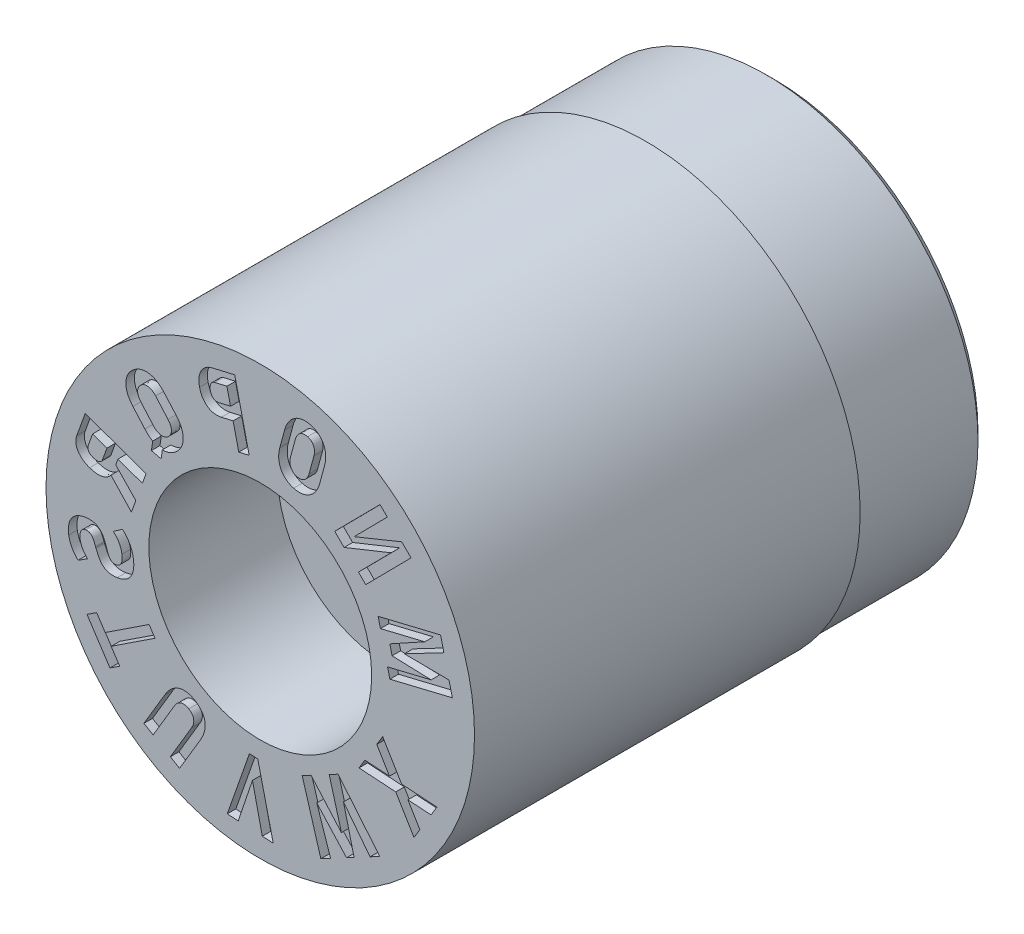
from build123d import *

# Parameters (mm, degrees)
SKETCH4_W          = 3
SKETCH4_H          = 1
CUT_EXTRUDE1_DEPTH = 0.2


with BuildPart() as part:
    # Sketch1 → Revolve1 (revolve)
    with BuildSketch(Plane(origin=(0, 0, 0), x_dir=(0, 0, -1), z_dir=(1, 0, 0)), mode=Mode.PRIVATE) as revolve1_sk:
        Polygon((0, 5), (0, 2.6), (3, 2.6), (3, 1.25), (12, 1.25), (12, 4.75), (11.75, 5), align=None)
    revolve(revolve1_sk.sketch.rotate(Axis((0, 0, 3.797909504), (0, 0, -1)), 90), axis=Axis((0, 0, 3.797909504), (0, 0, -1)))

    # Sketch4 → Cut-Revolve1 (revolve, cut)
    with BuildSketch(Plane(origin=(0, 0, 0), x_dir=(0, 0, -1), z_dir=(1, 0, 0)), mode=Mode.PRIVATE) as cut_revolve1_sk:
        with Locations((10.5, 5.435)):
            Rectangle(SKETCH4_W, SKETCH4_H)
    revolve(cut_revolve1_sk.sketch.rotate(Axis((0, 0, 0), (0, 0, -1)), 90), axis=Axis((0, 0, 0), (0, 0, -1)), mode=Mode.SUBTRACT)

    # Sketch5 → Cut-Extrude1 (cut)
    # profile 1 of 12: a face of its own
    with BuildSketch(Plane.XY):
        Polygon((4.286312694, 1.306940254), (4.208576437, 1.62736147), (2.750640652, 1.275007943), (2.804217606, 1.054164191), (3.839145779, 1.30427012), (3.024380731, 0.855363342), (3.076261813, 0.640519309), (3.986996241, 0.608730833), (2.971225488, 0.363254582), (3.024941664, 0.142138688), (4.482877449, 0.494492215), (4.405141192, 0.814913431), (3.363037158, 0.823624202), align=None)
    # profile 2 of 12: a face of its own
    with BuildSketch(Plane.XY):
        Polygon((3.519070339, 2.840419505), (3.301232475, 3.055736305), (2.190957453, 2.604921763), (2.965356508, 3.388090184), (2.795410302, 3.556232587), (1.737872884, 2.486813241), (1.956640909, 2.270283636), (3.054345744, 2.711036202), (2.291277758, 1.93944494), (2.461532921, 1.771000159), align=None)
    # profile 3 of 12: a face of its own
    with BuildSketch(Plane.XY):
        with BuildLine():
            Line((1.390128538, 3.28631436), (1.500789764, 3.695544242))
            add(Edge.make_bspline(
                [(1.500789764, 3.695544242), (1.514147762, 3.745621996), (1.528048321, 3.82092721), (1.528326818, 3.920557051), (1.521402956, 3.979278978), (1.511760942, 4.024213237), (1.50225362, 4.056347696), (1.491306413, 4.087306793), (1.47821599, 4.117018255), (1.462501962, 4.145005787), (1.445667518, 4.172129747), (1.426512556, 4.197783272), (1.405346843, 4.222010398), (1.382605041, 4.244974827), (1.357954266, 4.265880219), (1.332085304, 4.285344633), (1.304507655, 4.302775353), (1.27528629, 4.318378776), (1.233534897, 4.336795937), (1.200752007, 4.34801739), (1.178193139, 4.353955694)],
                knots=[0, 0, 0, 0, 0.188633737, 0.276446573, 0.361356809, 0.403048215, 0.4434031, 0.483104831, 0.522380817, 0.561263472, 0.599705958, 0.638378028, 0.677506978, 0.716595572, 0.755761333, 0.794913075, 0.834210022, 0.874247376, 0.915239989, 1, 1, 1, 1], degree=3))
            add(Edge.make_bspline(
                [(1.178193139, 4.353955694), (1.155738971, 4.360467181), (1.121688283, 4.366948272), (1.076353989, 4.372158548), (1.043146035, 4.373177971), (1.010421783, 4.372280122), (0.978251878, 4.368625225), (0.946540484, 4.362814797), (0.91549535, 4.354494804), (0.884958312, 4.344392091), (0.855644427, 4.331575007), (0.827254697, 4.316918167), (0.799703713, 4.300352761), (0.773504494, 4.281170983), (0.748074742, 4.260258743), (0.72394735, 4.23689203), (0.700720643, 4.211697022), (0.67900077, 4.184370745), (0.658204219, 4.155770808), (0.639470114, 4.125186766), (0.622262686, 4.092953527), (0.605919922, 4.059204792), (0.586734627, 4.010891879), (0.574177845, 3.973430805), (0.56758295, 3.947621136)],
                knots=[0, 0, 0, 0, 0.08483475, 0.125779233, 0.165706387, 0.205468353, 0.244646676, 0.283244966, 0.322521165, 0.361362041, 0.40002245, 0.438647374, 0.477421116, 0.516711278, 0.556542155, 0.596979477, 0.638670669, 0.680985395, 0.72376421, 0.767103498, 0.811194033, 0.856522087, 0.903286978, 1, 1, 1, 1], degree=3))
            Line((0.56758295, 3.947621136), (0.456921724, 3.538391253))
            add(Edge.make_bspline(
                [(0.456921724, 3.538391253), (0.443357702, 3.488309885), (0.429888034, 3.4129637), (0.429864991, 3.313410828), (0.43664145, 3.254888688), (0.44642717, 3.210079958), (0.455358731, 3.177825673), (0.46714328, 3.147164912), (0.479844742, 3.117328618), (0.495281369, 3.089205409), (0.512212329, 3.062078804), (0.531348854, 3.036413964), (0.552519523, 3.012189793), (0.575260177, 2.989225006), (0.599910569, 2.96831808), (0.625782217, 2.948860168), (0.653435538, 2.931350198), (0.68278369, 2.915809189), (0.724333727, 2.896722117), (0.75728456, 2.88589968), (0.779782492, 2.879825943)],
                knots=[0, 0, 0, 0, 0.188813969, 0.276321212, 0.361245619, 0.402420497, 0.443038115, 0.482794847, 0.52177743, 0.560858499, 0.599307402, 0.637985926, 0.677121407, 0.716216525, 0.755388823, 0.794547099, 0.833850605, 0.874264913, 0.915225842, 1, 1, 1, 1], degree=3))
            add(Edge.make_bspline(
                [(0.779782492, 2.879825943), (0.80238653, 2.87416152), (0.836178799, 2.866318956), (0.881581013, 2.86220415), (0.914714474, 2.86097771), (0.947444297, 2.861932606), (0.979615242, 2.865565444), (1.01131712, 2.871407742), (1.042474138, 2.879640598), (1.072865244, 2.890141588), (1.10231798, 2.902594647), (1.130715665, 2.917290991), (1.158106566, 2.934091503), (1.184486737, 2.953017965), (1.20973184, 2.974047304), (1.234161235, 2.996989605), (1.257285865, 3.022187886), (1.279081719, 3.049324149), (1.299337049, 3.078294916), (1.318647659, 3.108615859), (1.335855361, 3.140888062), (1.35172316, 3.174863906), (1.371048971, 3.223010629), (1.383495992, 3.260521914), (1.390128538, 3.28631436)],
                knots=[0, 0, 0, 0, 0.084853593, 0.125633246, 0.165579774, 0.205361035, 0.24455837, 0.283175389, 0.322470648, 0.361610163, 0.399991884, 0.438635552, 0.47775402, 0.516724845, 0.55657505, 0.597135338, 0.638484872, 0.68082013, 0.723586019, 0.766957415, 0.811439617, 0.856452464, 0.903240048, 1, 1, 1, 1], degree=3))
        make_face()
        with BuildLine():
            Line((0.704510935, 3.464219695), (0.818926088, 3.887182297))
            add(Edge.make_bspline(
                [(0.818926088, 3.887182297), (0.825292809, 3.910969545), (0.837655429, 3.945198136), (0.861035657, 3.986344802), (0.880815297, 4.013239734), (0.903185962, 4.036271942), (0.927274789, 4.056004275), (0.953670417, 4.071265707), (0.981757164, 4.082213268), (1.011194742, 4.089117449), (1.052654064, 4.09241989), (1.084144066, 4.087630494), (1.104653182, 4.081942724)],
                knots=[0, 0, 0, 0, 0.189969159, 0.278746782, 0.364115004, 0.446619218, 0.525697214, 0.603456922, 0.680631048, 0.757323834, 0.835778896, 1, 1, 1, 1], degree=3))
            add(Edge.make_bspline(
                [(1.104653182, 4.081942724), (1.125189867, 4.076556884), (1.154724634, 4.064934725), (1.188915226, 4.041226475), (1.210719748, 4.020239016), (1.229367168, 3.996595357), (1.244556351, 3.970350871), (1.255321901, 3.941213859), (1.262905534, 3.910038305), (1.266694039, 3.876854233), (1.266113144, 3.829549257), (1.259741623, 3.79376419), (1.253354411, 3.769979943)],
                knots=[0, 0, 0, 0, 0.164009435, 0.242129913, 0.3197738, 0.396745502, 0.473913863, 0.552775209, 0.635660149, 0.721077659, 0.80985478, 1, 1, 1, 1], degree=3))
            Line((1.253354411, 3.769979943), (1.138939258, 3.347017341))
            add(Edge.make_bspline(
                [(1.138939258, 3.347017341), (1.132568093, 3.323233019), (1.120218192, 3.288996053), (1.09676814, 3.247774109), (1.076965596, 3.220772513), (1.054616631, 3.197704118), (1.030495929, 3.178149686), (1.004219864, 3.163049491), (0.976287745, 3.151667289), (0.9467808, 3.145089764), (0.905366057, 3.142335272), (0.87394477, 3.146182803), (0.853476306, 3.152103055)],
                knots=[0, 0, 0, 0, 0.190102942, 0.278943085, 0.365152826, 0.447715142, 0.526115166, 0.603929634, 0.680672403, 0.757992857, 0.836057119, 1, 1, 1, 1], degree=3))
            add(Edge.make_bspline(
                [(0.853476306, 3.152103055), (0.833013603, 3.157900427), (0.803383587, 3.169356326), (0.769392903, 3.193223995), (0.747304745, 3.213736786), (0.728784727, 3.237572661), (0.713267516, 3.263728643), (0.702667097, 3.292944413), (0.694632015, 3.324020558), (0.691266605, 3.357277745), (0.691682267, 3.404639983), (0.69816131, 3.440441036), (0.704510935, 3.464219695)],
                knots=[0, 0, 0, 0, 0.164568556, 0.241873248, 0.31930577, 0.396245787, 0.474064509, 0.552893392, 0.635179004, 0.721192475, 0.809933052, 1, 1, 1, 1], degree=3))
        make_face(mode=Mode.SUBTRACT)
    # profile 4 of 12: a face of its own
    with BuildSketch(Plane.XY):
        with BuildLine():
            Line((-0.632674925, 3.533388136), (-0.501645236, 2.967718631))
            Line((-0.501645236, 2.967718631), (-0.258324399, 3.023986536))
            Line((-0.258324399, 3.023986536), (-0.59608493, 4.482135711))
            Line((-0.59608493, 4.482135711), (-1.113828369, 4.362230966))
            add(Edge.make_bspline(
                [(-1.113828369, 4.362230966), (-1.152065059, 4.353252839), (-1.207346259, 4.334209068), (-1.27244915, 4.294149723), (-1.314553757, 4.258439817), (-1.350838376, 4.217466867), (-1.381189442, 4.171843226), (-1.404553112, 4.121482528), (-1.42115562, 4.067060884), (-1.431668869, 4.009246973), (-1.434423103, 3.926247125), (-1.426326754, 3.863151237), (-1.416307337, 3.82117902)],
                knots=[0, 0, 0, 0, 0.169181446, 0.248915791, 0.327591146, 0.405821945, 0.483634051, 0.562500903, 0.643749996, 0.727834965, 0.814528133, 1, 1, 1, 1], degree=3))
            add(Edge.make_bspline(
                [(-1.416307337, 3.82117902), (-1.40699449, 3.778963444), (-1.386500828, 3.718632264), (-1.347056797, 3.645664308), (-1.312635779, 3.598192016), (-1.273592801, 3.55711733), (-1.230507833, 3.522424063), (-1.183518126, 3.494725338), (-1.132736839, 3.474403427), (-1.079294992, 3.461315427), (-1.003342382, 3.453748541), (-0.94544113, 3.4613555), (-0.907150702, 3.469777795)],
                knots=[0, 0, 0, 0, 0.186189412, 0.272787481, 0.356605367, 0.438128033, 0.51630851, 0.594255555, 0.672297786, 0.751180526, 0.830638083, 1, 1, 1, 1], degree=3))
            Line((-0.907150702, 3.469777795), (-0.632674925, 3.533388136))
        make_face()
        with BuildLine():
            Line((-0.693988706, 3.798086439), (-0.9748553, 3.733027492))
            add(Edge.make_bspline(
                [(-0.9748553, 3.733027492), (-0.988719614, 3.729988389), (-1.009876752, 3.727725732), (-1.037464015, 3.731631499), (-1.057166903, 3.737365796), (-1.075659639, 3.746512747), (-1.09347746, 3.757638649), (-1.109268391, 3.772413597), (-1.12403514, 3.789345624), (-1.13732978, 3.808659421), (-1.151962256, 3.838517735), (-1.160171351, 3.862598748), (-1.16380735, 3.879549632)],
                knots=[0, 0, 0, 0, 0.15921735, 0.234811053, 0.310679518, 0.387797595, 0.465050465, 0.544886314, 0.628703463, 0.71627665, 0.806375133, 1, 1, 1, 1], degree=3))
            add(Edge.make_bspline(
                [(-1.16380735, 3.879549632), (-1.168086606, 3.896534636), (-1.171497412, 3.922112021), (-1.171417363, 3.955664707), (-1.168430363, 3.979133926), (-1.162947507, 4.001110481), (-1.155206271, 4.021459), (-1.14472496, 4.039742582), (-1.131869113, 4.055915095), (-1.116659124, 4.069896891), (-1.09318279, 4.085459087), (-1.073086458, 4.093131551), (-1.059001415, 4.096092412)],
                knots=[0, 0, 0, 0, 0.194026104, 0.285030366, 0.37157159, 0.455815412, 0.535818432, 0.612326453, 0.688683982, 0.764157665, 0.840582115, 1, 1, 1, 1], degree=3))
            Line((-1.059001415, 4.096092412), (-0.778090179, 4.1611617))
            Line((-0.778090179, 4.1611617), (-0.693988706, 3.798086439))
        make_face(mode=Mode.SUBTRACT)
    # profile 5 of 12: a face of its own
    with BuildSketch(Plane.XY):
        with BuildLine():
            Line((-3.32129826, 1.417403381), (-2.750924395, 1.211899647))
            Line((-2.750924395, 1.211899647), (-2.665936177, 1.447691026))
            Line((-2.665936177, 1.447691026), (-4.084482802, 1.958788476))
            Line((-4.084482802, 1.958788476), (-4.281891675, 1.410645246))
            add(Edge.make_bspline(
                [(-4.281891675, 1.410645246), (-4.294035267, 1.378038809), (-4.304719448, 1.327343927), (-4.304502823, 1.25928486), (-4.295699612, 1.210117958), (-4.280187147, 1.162459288), (-4.256829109, 1.11713815), (-4.226806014, 1.074286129), (-4.189869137, 1.034148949), (-4.146362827, 0.997582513), (-4.079168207, 0.9520153), (-4.022021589, 0.926674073), (-3.982234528, 0.912175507)],
                knots=[0, 0, 0, 0, 0.159553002, 0.235612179, 0.311314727, 0.388075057, 0.465029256, 0.544635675, 0.627784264, 0.714856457, 0.805171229, 1, 1, 1, 1], degree=3))
            add(Edge.make_bspline(
                [(-3.982234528, 0.912175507), (-3.942533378, 0.897266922), (-3.882237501, 0.881764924), (-3.801664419, 0.872828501), (-3.744874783, 0.873810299), (-3.690931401, 0.881013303), (-3.640335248, 0.894596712), (-3.593832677, 0.915539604), (-3.551162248, 0.942232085), (-3.513925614, 0.974248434), (-3.492953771, 0.998790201), (-3.483651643, 1.011259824)],
                knots=[0, 0, 0, 0, 0.194722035, 0.284885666, 0.371920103, 0.455138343, 0.534536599, 0.611838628, 0.688719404, 0.765189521, 0.836632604, 0.836632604, 0.836632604, 0.836632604], degree=3))
            Line((-3.483651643, 1.011259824), (-3.006901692, 0.501392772))
            Line((-3.006901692, 0.501392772), (-2.903949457, 0.787036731))
            Line((-2.903949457, 0.787036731), (-3.372721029, 1.274569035))
            Line((-3.372721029, 1.274569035), (-3.32129826, 1.417403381))
        make_face()
        with BuildLine():
            Line((-3.578524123, 1.51008097), (-3.684165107, 1.21695499))
            add(Edge.make_bspline(
                [(-3.684165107, 1.21695499), (-3.688186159, 1.205435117), (-3.696678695, 1.189096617), (-3.71308205, 1.171282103), (-3.727502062, 1.160355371), (-3.743699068, 1.151568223), (-3.761442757, 1.144493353), (-3.781009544, 1.140473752), (-3.801978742, 1.138839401), (-3.824052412, 1.139478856), (-3.855545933, 1.143137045), (-3.879102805, 1.149420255), (-3.894830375, 1.154702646)],
                knots=[0, 0, 0, 0, 0.149319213, 0.221694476, 0.294550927, 0.369529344, 0.446510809, 0.527282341, 0.612761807, 0.703262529, 0.796933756, 1, 1, 1, 1], degree=3))
            add(Edge.make_bspline(
                [(-3.894830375, 1.154702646), (-3.910758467, 1.159922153), (-3.932800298, 1.170554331), (-3.959967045, 1.187105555), (-3.977039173, 1.201082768), (-3.991896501, 1.215727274), (-4.00454748, 1.23110805), (-4.013796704, 1.247828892), (-4.020762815, 1.26494886), (-4.024634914, 1.282658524), (-4.025554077, 1.307051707), (-4.022190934, 1.325339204), (-4.017624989, 1.336974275)],
                knots=[0, 0, 0, 0, 0.203595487, 0.297555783, 0.386975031, 0.471746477, 0.551629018, 0.628661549, 0.703686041, 0.7762233, 0.848312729, 1, 1, 1, 1], degree=3))
            Line((-4.017624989, 1.336974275), (-3.911944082, 1.63021103))
            Line((-3.911944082, 1.63021103), (-3.578524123, 1.51008097))
        make_face(mode=Mode.SUBTRACT)
    # profile 6 of 12: a face of its own
    with BuildSketch(Plane.XY):
        Polygon((-3.617986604, -2.236734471), (-3.817365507, -1.933942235), (-4.04421609, -2.083374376), (-3.507591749, -2.89833364), (-3.280741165, -2.748901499), (-3.480111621, -2.446122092), (-2.456432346, -1.772165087), (-2.594437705, -1.562863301), align=None)
    # profile 7 of 12: a face of its own
    with BuildSketch(Plane.XY):
        with BuildLine():
            Line((-2.51003597, 2.18750577), (-2.54015432, 1.979473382))
            Line((-2.54015432, 1.979473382), (-2.313098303, 1.923851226))
            Line((-2.313098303, 1.923851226), (-2.284762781, 2.122112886))
            add(Edge.make_bspline(
                [(-2.284762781, 2.122112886), (-2.277533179, 2.121919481), (-2.259621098, 2.121880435), (-2.230974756, 2.123313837), (-2.199049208, 2.127614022), (-2.167344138, 2.133850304), (-2.136252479, 2.142878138), (-2.105712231, 2.154168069), (-2.075556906, 2.167330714), (-2.046328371, 2.183611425), (-2.007343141, 2.207849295), (-1.980136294, 2.229713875), (-1.962331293, 2.244898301)],
                knots=[0.572911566, 0.572911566, 0.572911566, 0.572911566, 0.599119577, 0.637799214, 0.676765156, 0.715771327, 0.754807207, 0.793954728, 0.833729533, 0.873913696, 0.915098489, 1, 1, 1, 1], degree=3))
            add(Edge.make_bspline(
                [(-1.962331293, 2.244898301), (-1.945017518, 2.260587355), (-1.919824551, 2.284590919), (-1.890719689, 2.319981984), (-1.871429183, 2.347196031), (-1.854293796, 2.3751763), (-1.838933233, 2.403872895), (-1.826182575, 2.433688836), (-1.812356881, 2.474434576), (-1.800533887, 2.526960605), (-1.796027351, 2.591571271), (-1.800671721, 2.657423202), (-1.812315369, 2.712427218), (-1.826033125, 2.756411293), (-1.838955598, 2.789368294), (-1.853656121, 2.822076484), (-1.871035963, 2.854304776), (-1.890201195, 2.886500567), (-1.919705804, 2.929263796), (-1.944402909, 2.960071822), (-1.962014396, 2.980012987)],
                knots=[0, 0, 0, 0, 0.08482015, 0.125833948, 0.166006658, 0.205705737, 0.244763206, 0.283951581, 0.32316086, 0.40071608, 0.478448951, 0.557229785, 0.639391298, 0.681720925, 0.724221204, 0.767703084, 0.811693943, 0.856942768, 0.903529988, 1, 1, 1, 1], degree=3))
            Line((-1.962014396, 2.980012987), (-2.242218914, 3.298670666))
            add(Edge.make_bspline(
                [(-2.242218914, 3.298670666), (-2.276671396, 3.337391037), (-2.331797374, 3.390668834), (-2.414830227, 3.445915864), (-2.467587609, 3.472856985), (-2.510693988, 3.489048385), (-2.542690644, 3.499230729), (-2.574810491, 3.506671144), (-2.606837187, 3.512182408), (-2.638926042, 3.515109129), (-2.670995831, 3.515461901), (-2.703067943, 3.51382725), (-2.735061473, 3.509679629), (-2.766628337, 3.502841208), (-2.797855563, 3.49437914), (-2.828430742, 3.48305989), (-2.858338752, 3.469411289), (-2.887806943, 3.453744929), (-2.92627101, 3.428921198), (-2.953981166, 3.407927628), (-2.971415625, 3.392234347)],
                knots=[0, 0, 0, 0, 0.188187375, 0.275929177, 0.360881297, 0.402284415, 0.442800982, 0.482543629, 0.521736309, 0.560559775, 0.599240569, 0.637939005, 0.676923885, 0.716069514, 0.754979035, 0.794145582, 0.834133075, 0.874120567, 0.915041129, 1, 1, 1, 1], degree=3))
            add(Edge.make_bspline(
                [(-2.971415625, 3.392234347), (-2.989024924, 3.376699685), (-3.013690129, 3.352044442), (-3.043430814, 3.317006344), (-3.062536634, 3.289702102), (-3.079936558, 3.261882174), (-3.094995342, 3.233131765), (-3.107951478, 3.203412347), (-3.121619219, 3.162705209), (-3.133947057, 3.110290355), (-3.138283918, 3.045632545), (-3.133727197, 2.979883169), (-3.121990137, 2.924982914), (-3.108189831, 2.881044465), (-3.095582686, 2.847954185), (-3.080459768, 2.815344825), (-3.063432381, 2.782941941), (-3.044144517, 2.750711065), (-3.014544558, 2.707937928), (-2.990203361, 2.676763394), (-2.972378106, 2.656895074)],
                knots=[0, 0, 0, 0, 0.08508328, 0.126277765, 0.166433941, 0.205779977, 0.245167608, 0.283984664, 0.323177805, 0.40073542, 0.478436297, 0.557184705, 0.63896357, 0.681275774, 0.724083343, 0.76723381, 0.811508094, 0.856738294, 0.90330634, 1, 1, 1, 1], degree=3))
            Line((-2.972378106, 2.656895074), (-2.692173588, 2.338237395))
            add(Edge.make_bspline(
                [(-2.692173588, 2.338237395), (-2.657671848, 2.299568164), (-2.602718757, 2.246176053), (-2.536512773, 2.202407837), (-2.512753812, 2.189009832), (-2.51003597, 2.18750577)],
                knots=[0, 0, 0, 0, 0.188095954, 0.275632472, 0.286882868, 0.286882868, 0.286882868, 0.286882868], degree=3))
        make_face()
        with BuildLine():
            Line((-2.49213704, 2.504659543), (-2.781773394, 2.83378663))
            add(Edge.make_bspline(
                [(-2.781773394, 2.83378663), (-2.798160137, 2.852351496), (-2.819589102, 2.881784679), (-2.841101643, 2.924054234), (-2.852415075, 2.955355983), (-2.859713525, 2.986677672), (-2.862243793, 3.017653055), (-2.860127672, 3.048120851), (-2.853850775, 3.077720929), (-2.843347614, 3.106320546), (-2.822951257, 3.142901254), (-2.801282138, 3.166507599), (-2.785215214, 3.180695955)],
                knots=[0, 0, 0, 0, 0.190295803, 0.278272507, 0.363741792, 0.445510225, 0.524772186, 0.601669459, 0.679458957, 0.756595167, 0.834985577, 1, 1, 1, 1], degree=3))
            add(Edge.make_bspline(
                [(-2.785215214, 3.180695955), (-2.769176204, 3.194776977), (-2.742896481, 3.21276088), (-2.704191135, 3.228538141), (-2.674583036, 3.235521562), (-2.644430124, 3.237768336), (-2.614089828, 3.235670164), (-2.583657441, 3.229288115), (-2.553539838, 3.218085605), (-2.523944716, 3.202779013), (-2.48485403, 3.175997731), (-2.458414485, 3.150936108), (-2.442255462, 3.132248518)],
                knots=[0, 0, 0, 0, 0.164323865, 0.242647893, 0.320593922, 0.397514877, 0.474531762, 0.554006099, 0.636025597, 0.721137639, 0.809891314, 1, 1, 1, 1], degree=3))
            Line((-2.442255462, 3.132248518), (-2.152619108, 2.80312143))
            add(Edge.make_bspline(
                [(-2.152619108, 2.80312143), (-2.136484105, 2.784485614), (-2.114643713, 2.755409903), (-2.093272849, 2.713145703), (-2.08187543, 2.681775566), (-2.074696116, 2.650315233), (-2.072249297, 2.619255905), (-2.073858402, 2.58885577), (-2.080173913, 2.559298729), (-2.091083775, 2.530945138), (-2.111297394, 2.494428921), (-2.132774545, 2.470815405), (-2.148795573, 2.456779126)],
                knots=[0, 0, 0, 0, 0.189977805, 0.278085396, 0.363681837, 0.446308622, 0.525688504, 0.602752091, 0.679875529, 0.75730548, 0.835812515, 1, 1, 1, 1], degree=3))
            add(Edge.make_bspline(
                [(-2.148795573, 2.456779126), (-2.164689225, 2.442218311), (-2.191360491, 2.424587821), (-2.230069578, 2.408700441), (-2.259586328, 2.401702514), (-2.289625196, 2.399028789), (-2.320032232, 2.40112285), (-2.350360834, 2.407982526), (-2.380602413, 2.41910574), (-2.410251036, 2.434410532), (-2.449713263, 2.46073351), (-2.475901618, 2.48608442), (-2.49213704, 2.504659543)],
                knots=[0, 0, 0, 0, 0.165328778, 0.243569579, 0.320699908, 0.397702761, 0.474637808, 0.554093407, 0.636025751, 0.721784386, 0.810093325, 1, 1, 1, 1], degree=3))
        make_face(mode=Mode.SUBTRACT)
    # profile 8 of 12: a face of its own
    with BuildSketch(Plane.XY):
        with BuildLine():
            Line((-3.215677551, 0.049791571), (-3.429618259, -0.099031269))
            add(Edge.make_bspline(
                [(-3.429618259, -0.099031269), (-3.402436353, -0.120759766), (-3.365416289, -0.157886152), (-3.322848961, -0.21351659), (-3.294958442, -0.258813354), (-3.271187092, -0.306531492), (-3.244631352, -0.372220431), (-3.232692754, -0.424013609), (-3.227574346, -0.458858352)],
                knots=[0, 0, 0, 0, 0.24699557, 0.371005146, 0.497151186, 0.624435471, 0.749537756, 1, 1, 1, 1], degree=3))
            add(Edge.make_bspline(
                [(-3.227574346, -0.458858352), (-3.224926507, -0.477960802), (-3.22159562, -0.50610811), (-3.221923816, -0.542816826), (-3.223173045, -0.568111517), (-3.226449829, -0.591871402), (-3.231373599, -0.614121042), (-3.237868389, -0.634955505), (-3.246462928, -0.654039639), (-3.256028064, -0.671801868), (-3.267883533, -0.687285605), (-3.280809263, -0.701172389), (-3.295281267, -0.71326396), (-3.311517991, -0.723081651), (-3.335663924, -0.733604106), (-3.35516144, -0.738398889), (-3.368585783, -0.74042539)],
                knots=[0, 0, 0, 0, 0.163211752, 0.238687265, 0.310056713, 0.377124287, 0.441113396, 0.502499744, 0.561161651, 0.617797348, 0.672569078, 0.725446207, 0.777915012, 0.831391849, 0.885228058, 1, 1, 1, 1], degree=3))
            add(Edge.make_bspline(
                [(-3.368585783, -0.74042539), (-3.387389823, -0.743776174), (-3.413898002, -0.74369594), (-3.447102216, -0.735626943), (-3.468031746, -0.724648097), (-3.486571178, -0.710677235), (-3.503300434, -0.694193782), (-3.51795234, -0.674877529), (-3.530726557, -0.652810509), (-3.542396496, -0.627743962), (-3.558789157, -0.588292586), (-3.570534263, -0.556755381), (-3.577849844, -0.534429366)],
                knots=[0, 0, 0, 0, 0.167076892, 0.241680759, 0.312795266, 0.383261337, 0.45517203, 0.528631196, 0.606108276, 0.689828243, 0.783415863, 1, 1, 1, 1], degree=3))
            add(Edge.make_bspline(
                [(-3.577849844, -0.534429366), (-3.57831097, -0.532755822), (-3.579406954, -0.52945729), (-3.580178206, -0.52602295), (-3.581376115, -0.524633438)],
                knots=[0, 0, 0, 0, 0.496792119, 1, 1, 1, 1], degree=3))
            Line((-3.581376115, -0.524633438), (-3.587082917, -0.50528212))
            add(Edge.make_bspline(
                [(-3.587082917, -0.50528212), (-3.600373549, -0.465686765), (-3.620693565, -0.409001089), (-3.652801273, -0.339212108), (-3.676515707, -0.294256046), (-3.703884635, -0.254106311), (-3.737675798, -0.21927375), (-3.777364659, -0.188580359), (-3.814984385, -0.166994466), (-3.848315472, -0.152681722), (-3.875782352, -0.14380669), (-3.905398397, -0.137820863), (-3.936941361, -0.133470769), (-3.970445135, -0.131844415), (-4.019352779, -0.132096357), (-4.05687994, -0.135935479), (-4.082481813, -0.139543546)],
                knots=[0, 0, 0, 0, 0.181067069, 0.260489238, 0.332707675, 0.401119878, 0.470233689, 0.542036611, 0.617915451, 0.657429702, 0.699064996, 0.742722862, 0.788178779, 0.836914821, 0.887917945, 1, 1, 1, 1], degree=3))
            Line((-4.082481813, -0.139543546), (-4.08365462, -0.139889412))
            add(Edge.make_bspline(
                [(-4.08365462, -0.139889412), (-4.106905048, -0.143009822), (-4.140786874, -0.149969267), (-4.184410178, -0.162158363), (-4.214894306, -0.17317891), (-4.243936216, -0.185503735), (-4.271545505, -0.199284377), (-4.297392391, -0.214943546), (-4.321565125, -0.232255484), (-4.344043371, -0.251091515), (-4.36519655, -0.270956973), (-4.384314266, -0.292518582), (-4.401373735, -0.315695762), (-4.417525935, -0.339679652), (-4.431030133, -0.365576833), (-4.443442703, -0.392559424), (-4.457225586, -0.430982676), (-4.47033339, -0.482493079), (-4.479782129, -0.573485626), (-4.476401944, -0.644169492), (-4.468983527, -0.692057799)],
                knots=[0, 0, 0, 0, 0.091894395, 0.135435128, 0.177444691, 0.218865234, 0.259058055, 0.298296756, 0.337204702, 0.375492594, 0.413186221, 0.450869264, 0.488256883, 0.52595051, 0.564081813, 0.602598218, 0.642303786, 0.723961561, 0.810241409, 1, 1, 1, 1], degree=3))
            add(Edge.make_bspline(
                [(-4.468983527, -0.692057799), (-4.46579245, -0.716017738), (-4.45746886, -0.751561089), (-4.443424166, -0.798666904), (-4.425387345, -0.846173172), (-4.397654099, -0.904758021), (-4.342830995, -0.995044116), (-4.290871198, -1.05604301), (-4.252522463, -1.093207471)],
                knots=[0, 0, 0, 0, 0.156128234, 0.235900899, 0.317863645, 0.484670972, 0.654494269, 1, 1, 1, 1], degree=3))
            Line((-4.252522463, -1.093207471), (-4.030398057, -0.953763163))
            add(Edge.make_bspline(
                [(-4.030398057, -0.953763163), (-4.053238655, -0.9317892), (-4.084971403, -0.896849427), (-4.121709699, -0.846610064), (-4.145857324, -0.808416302), (-4.165770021, -0.769470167), (-4.187463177, -0.718832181), (-4.197066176, -0.679340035), (-4.201243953, -0.653256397)],
                knots=[0, 0, 0, 0, 0.270399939, 0.401570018, 0.530660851, 0.65546814, 0.774418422, 1, 1, 1, 1], degree=3))
            add(Edge.make_bspline(
                [(-4.201243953, -0.653256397), (-4.206368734, -0.619227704), (-4.209080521, -0.569940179), (-4.199701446, -0.508278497), (-4.188168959, -0.476058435), (-4.175753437, -0.453841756), (-4.165352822, -0.439185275), (-4.15368354, -0.426310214), (-4.140498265, -0.4153597), (-4.125911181, -0.406263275), (-4.104209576, -0.396532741), (-4.08675591, -0.391602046), (-4.074520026, -0.390244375)],
                knots=[0, 0, 0, 0, 0.31465832, 0.447071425, 0.567546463, 0.624824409, 0.679206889, 0.731418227, 0.783129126, 0.83530725, 0.887973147, 1, 1, 1, 1], degree=3))
            Line((-4.074520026, -0.390244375), (-4.073260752, -0.39019171))
            add(Edge.make_bspline(
                [(-4.073260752, -0.39019171), (-4.053867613, -0.38707355), (-4.025244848, -0.386855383), (-3.989432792, -0.395575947), (-3.96690744, -0.407474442), (-3.947079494, -0.422440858), (-3.928948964, -0.439538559), (-3.913737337, -0.45947561), (-3.89995452, -0.481808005), (-3.887080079, -0.507706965), (-3.867696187, -0.550821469), (-3.853403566, -0.585876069), (-3.844009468, -0.611008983)],
                knots=[0, 0, 0, 0, 0.167349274, 0.241492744, 0.312252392, 0.383060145, 0.453191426, 0.524265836, 0.596438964, 0.676966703, 0.770953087, 1, 1, 1, 1], degree=3))
            add(Edge.make_bspline(
                [(-3.844009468, -0.611008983), (-3.842894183, -0.61310636), (-3.84197434, -0.61796825), (-3.839808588, -0.622409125), (-3.838979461, -0.624823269)],
                knots=[0, 0, 0, 0, 0.478861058, 1, 1, 1, 1], degree=3))
            add(Edge.make_bspline(
                [(-3.838979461, -0.624823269), (-3.837949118, -0.62837229), (-3.835027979, -0.635026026), (-3.832106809, -0.641679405), (-3.831081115, -0.645121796)],
                knots=[0, 0, 0, 0, 0.507003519, 1, 1, 1, 1], degree=3))
            add(Edge.make_bspline(
                [(-3.831081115, -0.645121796), (-3.816333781, -0.682392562), (-3.794819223, -0.736179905), (-3.760110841, -0.801722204), (-3.734918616, -0.844395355), (-3.706113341, -0.882515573), (-3.671506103, -0.915173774), (-3.631708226, -0.94374552), (-3.59451715, -0.963695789), (-3.561843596, -0.976752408), (-3.535195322, -0.984528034), (-3.506813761, -0.990173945), (-3.476769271, -0.99413787), (-3.444937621, -0.995388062), (-3.399021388, -0.995004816), (-3.363750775, -0.991925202), (-3.339821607, -0.988178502)],
                knots=[0, 0, 0, 0, 0.180519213, 0.259996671, 0.333498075, 0.403308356, 0.474158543, 0.546692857, 0.623198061, 0.663365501, 0.704820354, 0.747886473, 0.793456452, 0.841010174, 0.891072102, 1, 1, 1, 1], degree=3))
            Line((-3.339821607, -0.988178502), (-3.337682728, -0.987866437))
            add(Edge.make_bspline(
                [(-3.337682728, -0.987866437), (-3.314950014, -0.984322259), (-3.281412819, -0.978078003), (-3.238508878, -0.965280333), (-3.208219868, -0.954598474), (-3.179565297, -0.941966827), (-3.152471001, -0.927620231), (-3.126995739, -0.911494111), (-3.103073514, -0.893809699), (-3.08053383, -0.874963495), (-3.060181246, -0.85397892), (-3.041151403, -0.831994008), (-3.024164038, -0.808296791), (-3.008726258, -0.783304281), (-2.995309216, -0.756631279), (-2.983473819, -0.728541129), (-2.969820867, -0.688831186), (-2.957544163, -0.635618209), (-2.94792281, -0.542035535), (-2.952649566, -0.469314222), (-2.959834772, -0.420056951)],
                knots=[0, 0, 0, 0, 0.089181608, 0.131807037, 0.173316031, 0.213507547, 0.25298343, 0.29196294, 0.330167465, 0.368157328, 0.40561035, 0.443268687, 0.480688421, 0.518414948, 0.556944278, 0.596210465, 0.636401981, 0.719477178, 0.807065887, 1, 1, 1, 1], degree=3))
            add(Edge.make_bspline(
                [(-2.959834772, -0.420056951), (-2.96398894, -0.388787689), (-2.974056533, -0.342600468), (-2.991673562, -0.28227162), (-3.007563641, -0.238216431), (-3.025793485, -0.195578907), (-3.046592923, -0.154577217), (-3.069554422, -0.115216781), (-3.095079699, -0.077795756), (-3.122182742, -0.042225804), (-3.161362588, 0.001441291), (-3.192665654, 0.031982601), (-3.215677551, 0.049791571)],
                knots=[0, 0, 0, 0, 0.172684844, 0.25867659, 0.344257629, 0.429171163, 0.512627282, 0.596051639, 0.67869683, 0.760720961, 0.84090555, 1, 1, 1, 1], degree=3))
        make_face()
    # profile 9 of 12: a face of its own
    with BuildSketch(Plane.XY):
        with BuildLine():
            Line((-2.225062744, -2.796828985), (-2.714799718, -3.621065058))
            Line((-2.714799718, -3.621065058), (-2.500185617, -3.748497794))
            Line((-2.500185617, -3.748497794), (-2.00671344, -2.91770055))
            add(Edge.make_bspline(
                [(-2.00671344, -2.91770055), (-1.996464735, -2.900065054), (-1.979557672, -2.875487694), (-1.954641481, -2.845859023), (-1.935480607, -2.827063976), (-1.915766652, -2.810682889), (-1.895356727, -2.796585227), (-1.874023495, -2.785389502), (-1.852107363, -2.77656282), (-1.829820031, -2.770306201), (-1.807171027, -2.76658), (-1.784325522, -2.766335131), (-1.761222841, -2.767875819), (-1.737951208, -2.772958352), (-1.705783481, -2.7829566), (-1.682595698, -2.794566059), (-1.667534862, -2.803535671)],
                knots=[0, 0, 0, 0, 0.15053503, 0.219853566, 0.285595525, 0.348466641, 0.408969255, 0.468423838, 0.526015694, 0.583153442, 0.639089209, 0.694959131, 0.751524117, 0.809722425, 0.870393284, 1, 1, 1, 1], degree=3))
            add(Edge.make_bspline(
                [(-1.667534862, -2.803535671), (-1.652505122, -2.812779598), (-1.630755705, -2.827259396), (-1.606607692, -2.851021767), (-1.590808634, -2.869031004), (-1.578236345, -2.888758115), (-1.567601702, -2.909231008), (-1.559677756, -2.930881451), (-1.554484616, -2.95353786), (-1.551294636, -2.976936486), (-1.551314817, -3.00107174), (-1.553638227, -3.025732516), (-1.558285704, -3.051064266), (-1.566112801, -3.076813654), (-1.579777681, -3.113011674), (-1.593797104, -3.13935428), (-1.604168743, -3.156819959)],
                knots=[0, 0, 0, 0, 0.130261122, 0.190752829, 0.249003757, 0.306182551, 0.362453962, 0.418565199, 0.475334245, 0.533275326, 0.59199754, 0.652531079, 0.71543437, 0.781196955, 0.850345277, 1, 1, 1, 1], degree=3))
            Line((-1.604168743, -3.156819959), (-2.09764092, -3.987617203))
            Line((-2.09764092, -3.987617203), (-1.883295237, -4.115196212))
            Line((-1.883295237, -4.115196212), (-1.393558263, -3.29096014))
            add(Edge.make_bspline(
                [(-1.393558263, -3.29096014), (-1.379108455, -3.266481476), (-1.358729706, -3.229800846), (-1.336408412, -3.17960423), (-1.322044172, -3.143238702), (-1.309824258, -3.107428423), (-1.300068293, -3.072004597), (-1.292623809, -3.037081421), (-1.287771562, -3.002572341), (-1.28473341, -2.968726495), (-1.284954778, -2.935530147), (-1.286575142, -2.90305906), (-1.291543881, -2.871553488), (-1.297956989, -2.840632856), (-1.307037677, -2.810527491), (-1.318949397, -2.781350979), (-1.332623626, -2.752871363), (-1.348625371, -2.725245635), (-1.367440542, -2.698902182), (-1.387861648, -2.673224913), (-1.410698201, -2.648760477), (-1.435977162, -2.625619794), (-1.473156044, -2.595587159), (-1.503154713, -2.574919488), (-1.524478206, -2.562652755)],
                knots=[0, 0, 0, 0, 0.101538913, 0.149563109, 0.196051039, 0.241106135, 0.284588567, 0.327166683, 0.368495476, 0.40895852, 0.448359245, 0.486931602, 0.524914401, 0.562095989, 0.599626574, 0.636991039, 0.674507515, 0.712359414, 0.750808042, 0.789986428, 0.829429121, 0.87015626, 0.912246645, 1, 1, 1, 1], degree=3))
            add(Edge.make_bspline(
                [(-1.524478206, -2.562652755), (-1.54577972, -2.550206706), (-1.57792958, -2.533093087), (-1.622072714, -2.514840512), (-1.654445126, -2.503828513), (-1.686850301, -2.495741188), (-1.718992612, -2.489873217), (-1.750964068, -2.486165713), (-1.782795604, -2.485534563), (-1.814301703, -2.48693173), (-1.84532149, -2.491038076), (-1.876033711, -2.497066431), (-1.906247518, -2.506013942), (-1.936050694, -2.517315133), (-1.96522401, -2.531272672), (-1.99418744, -2.547286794), (-2.022544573, -2.566060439), (-2.050577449, -2.586790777), (-2.077711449, -2.609985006), (-2.10388689, -2.635591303), (-2.129696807, -2.66318339), (-2.154755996, -2.693287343), (-2.18772244, -2.73726526), (-2.21075141, -2.772329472), (-2.225062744, -2.796828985)],
                knots=[0, 0, 0, 0, 0.088264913, 0.129981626, 0.170724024, 0.210436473, 0.249307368, 0.287520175, 0.325397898, 0.363047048, 0.40019911, 0.43719895, 0.474867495, 0.512746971, 0.551072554, 0.590430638, 0.631013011, 0.672602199, 0.715055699, 0.758555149, 0.803497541, 0.850122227, 0.898557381, 1, 1, 1, 1], degree=3))
        make_face()
    # profile 10 of 12: a face of its own
    with BuildSketch(Plane.XY):
        Polygon((-0.769620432, -4.478141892), (-0.513795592, -4.491643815), (-0.181226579, -3.505705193), (0.047091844, -4.520964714), (0.302948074, -4.534162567), (-0.057977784, -3.011366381), (-0.252066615, -3.001164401), align=None)
    # profile 11 of 12: a face of its own
    with BuildSketch(Plane.XY):
        Polygon((2.01333545, -3.973207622), (2.189877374, -3.878785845), (1.942767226, -2.879287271), (2.562736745, -3.679639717), (2.789354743, -3.558784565), (1.815856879, -2.382625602), (1.609014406, -2.49317818), (1.894123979, -3.525481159), (1.185314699, -2.71934958), (0.978472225, -2.829902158), (1.413858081, -4.293208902), (1.640222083, -4.17218366), (1.32020329, -3.211788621), align=None)
    # profile 12 of 12: a face of its own
    with BuildSketch(Plane.XY):
        Polygon((3.162115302, -2.067313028), (3.587180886, -2.777535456), (3.724447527, -2.551521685), (3.445597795, -2.085694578), (3.985942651, -2.120771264), (4.123209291, -1.894757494), (3.298675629, -1.841013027), (2.857072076, -1.102172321), (2.719534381, -1.328327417), (3.015743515, -1.822602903), (2.44207748, -1.785326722), (2.30468111, -2.011752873), align=None)
    extrude(amount=-CUT_EXTRUDE1_DEPTH, mode=Mode.SUBTRACT)


solid = part.part
